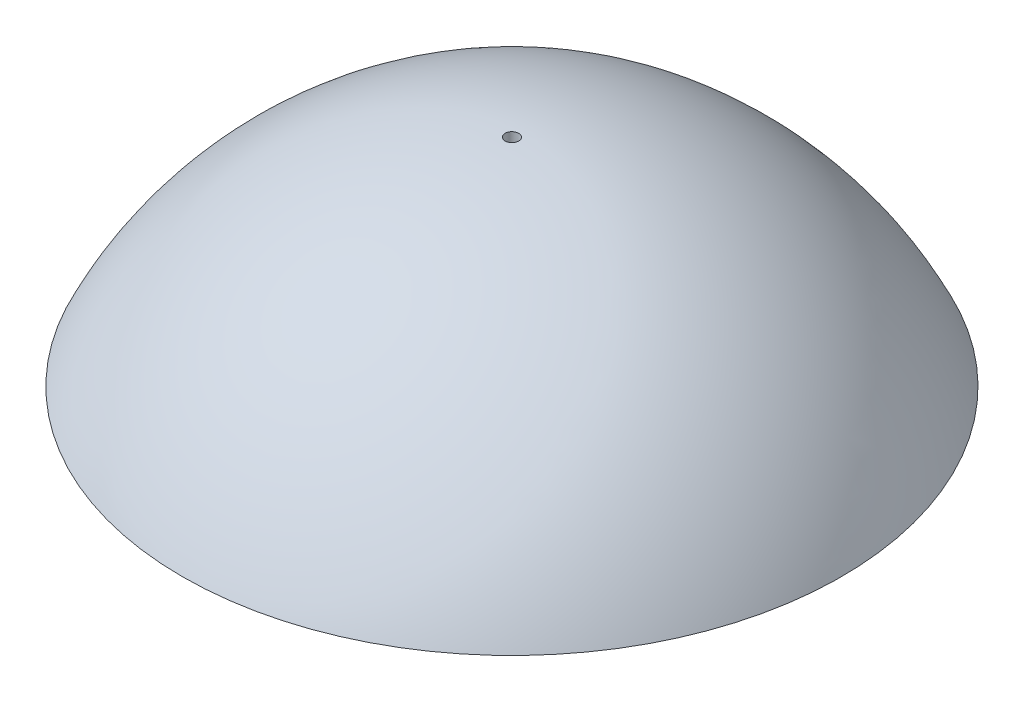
ISO-10303-21;
HEADER;
FILE_DESCRIPTION(('STEP AP214'),'2;1');
FILE_NAME('part.step','',(''),(''),'','','');
FILE_SCHEMA(('AUTOMOTIVE_DESIGN { 1 0 10303 214 1 1 1 1 }'));
ENDSEC;
DATA;
#1=APPLICATION_CONTEXT('core data for automotive mechanical design processes');
#2=APPLICATION_PROTOCOL_DEFINITION('international standard','automotive_design',2000,#1);
#3=PRODUCT_CONTEXT('',#1,'mechanical');
#4=PRODUCT('Part','Part','',(#3));
#5=PRODUCT_RELATED_PRODUCT_CATEGORY('part','',(#4));
#6=PRODUCT_DEFINITION_FORMATION('','',#4);
#7=PRODUCT_DEFINITION_CONTEXT('part definition',#1,'design');
#8=PRODUCT_DEFINITION('design','',#6,#7);
#9=PRODUCT_DEFINITION_SHAPE('','',#8);
#10=(LENGTH_UNIT() NAMED_UNIT(*) SI_UNIT(.MILLI.,.METRE.));
#11=(NAMED_UNIT(*) PLANE_ANGLE_UNIT() SI_UNIT($,.RADIAN.));
#12=(NAMED_UNIT(*) SI_UNIT($,.STERADIAN.) SOLID_ANGLE_UNIT());
#13=UNCERTAINTY_MEASURE_WITH_UNIT(LENGTH_MEASURE(1.E-05),#10,'distance_accuracy_value','');
#14=(GEOMETRIC_REPRESENTATION_CONTEXT(3) GLOBAL_UNCERTAINTY_ASSIGNED_CONTEXT((#13)) GLOBAL_UNIT_ASSIGNED_CONTEXT((#10,
#11,#12)) REPRESENTATION_CONTEXT('',''));
#15=CARTESIAN_POINT('',(0.,0.,0.));
#16=DIRECTION('',(0.,0.,1.));
#17=DIRECTION('',(1.,0.,0.));
#18=AXIS2_PLACEMENT_3D('',#15,#16,#17);
#19=CARTESIAN_POINT('',(0.,59.3847673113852,0.));
#20=CARTESIAN_POINT('',(0.,59.8901645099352,52.5535567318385));
#21=CARTESIAN_POINT('',(0.,26.0046128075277,99.8897687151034));
#22=CARTESIAN_POINT('',(0.,-20.1902768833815,121.482653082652));
#23=B_SPLINE_CURVE_WITH_KNOTS('',3,(#19,#20,#21,#22),.UNSPECIFIED.,.F.,.F.,(4,4),(0.,1.),.UNSPECIFIED.);
#24=CARTESIAN_POINT('',(0.,0.,0.));
#25=DIRECTION('',(0.,1.,0.));
#26=AXIS1_PLACEMENT('',#24,#25);
#27=SURFACE_OF_REVOLUTION('',#23,#26);
#28=CARTESIAN_POINT('',(0.,59.383030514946,0.));
#29=DIRECTION('',(0.,1.,0.));
#30=DIRECTION('',(0.,0.,1.));
#31=AXIS2_PLACEMENT_3D('',#28,#29,#30);
#32=CIRCLE('',#31,2.4892);
#33=CARTESIAN_POINT('',(0.,59.383030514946,2.4892));
#34=VERTEX_POINT('',#33);
#35=EDGE_CURVE('E51',#34,#34,#32,.T.);
#36=ORIENTED_EDGE('',*,*,#35,.F.);
#37=EDGE_LOOP('',(#36));
#38=FACE_BOUND('',#37,.T.);
#39=CARTESIAN_POINT('',(0.,-20.1902768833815,0.));
#40=DIRECTION('',(0.,1.,0.));
#41=DIRECTION('',(0.,0.,1.));
#42=AXIS2_PLACEMENT_3D('',#39,#40,#41);
#43=CIRCLE('',#42,121.482653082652);
#44=CARTESIAN_POINT('',(0.,-20.1902768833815,121.482653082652));
#45=VERTEX_POINT('',#44);
#46=EDGE_CURVE('E39',#45,#45,#43,.T.);
#47=ORIENTED_EDGE('',*,*,#46,.T.);
#48=EDGE_LOOP('',(#47));
#49=FACE_BOUND('',#48,.T.);
#50=ADVANCED_FACE('F32',(#38,#49),#27,.F.);
#51=CARTESIAN_POINT('',(0.,-112.210519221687,-3.6062110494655E-12));
#52=DIRECTION('',(0.,1.,0.));
#53=DIRECTION('',(0.,0.,1.));
#54=AXIS2_PLACEMENT_3D('',#51,#52,#53);
#55=SPHERICAL_SURFACE('',#54,152.400000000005);
#56=CARTESIAN_POINT('',(0.,0.,0.));
#57=DIRECTION('',(0.,1.,0.));
#58=DIRECTION('',(0.,0.,1.));
#59=AXIS2_PLACEMENT_3D('',#56,#57,#58);
#60=CIRCLE('',#59,103.124);
#61=CARTESIAN_POINT('',(0.,0.,103.124));
#62=VERTEX_POINT('',#61);
#63=EDGE_CURVE('E43',#62,#62,#60,.T.);
#64=CARTESIAN_POINT('',(0.,0.,103.124));
#65=CARTESIAN_POINT('',(0.,-0.192607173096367,103.333578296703));
#66=CARTESIAN_POINT('',(0.,-0.385801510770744,103.542616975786));
#67=CARTESIAN_POINT('',(0.,-0.773358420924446,103.959608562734));
#68=CARTESIAN_POINT('',(0.,-0.967720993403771,104.167561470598));
#69=CARTESIAN_POINT('',(0.,-1.3576082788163,104.582374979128));
#70=CARTESIAN_POINT('',(0.,-1.5531329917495,104.789235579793));
#71=CARTESIAN_POINT('',(0.,-1.9453384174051,105.20185798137));
#72=CARTESIAN_POINT('',(0.,-2.14201913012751,105.407619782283));
#73=CARTESIAN_POINT('',(0.,-2.53653038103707,105.818038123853));
#74=CARTESIAN_POINT('',(0.,-2.73436091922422,106.02269466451));
#75=CARTESIAN_POINT('',(0.,-3.13116560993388,106.430896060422));
#76=CARTESIAN_POINT('',(0.,-3.33013976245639,106.634440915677));
#77=CARTESIAN_POINT('',(0.,-3.72922543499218,107.040412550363));
#78=CARTESIAN_POINT('',(0.,-3.92933695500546,107.242839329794));
#79=CARTESIAN_POINT('',(0.,-4.33069107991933,107.646568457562));
#80=CARTESIAN_POINT('',(0.,-4.53193368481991,107.847870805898));
#81=CARTESIAN_POINT('',(0.,-4.93554366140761,108.249344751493));
#82=CARTESIAN_POINT('',(0.,-5.13791103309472,108.449516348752));
#83=CARTESIAN_POINT('',(0.,-5.54376418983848,108.848722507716));
#84=CARTESIAN_POINT('',(0.,-5.74724997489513,109.04775706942));
#85=CARTESIAN_POINT('',(0.,-6.15533356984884,109.444682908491));
#86=CARTESIAN_POINT('',(0.,-6.35993137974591,109.642574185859));
#87=CARTESIAN_POINT('',(0.,-6.77023260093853,110.037207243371));
#88=CARTESIAN_POINT('',(0.,-6.97593601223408,110.233949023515));
#89=CARTESIAN_POINT('',(0.,-7.38844197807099,110.626276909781));
#90=CARTESIAN_POINT('',(0.,-7.59524453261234,110.821863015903));
#91=CARTESIAN_POINT('',(0.,-8.00994229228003,111.21187341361));
#92=CARTESIAN_POINT('',(0.,-8.21783749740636,111.406297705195));
#93=CARTESIAN_POINT('',(0.,-8.6347140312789,111.793978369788));
#94=CARTESIAN_POINT('',(0.,-8.84369536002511,111.987234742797));
#95=CARTESIAN_POINT('',(0.,-9.26273758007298,112.372573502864));
#96=CARTESIAN_POINT('',(0.,-9.47279847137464,112.564655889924));
#97=CARTESIAN_POINT('',(0.,-9.8939932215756,112.947640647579));
#98=CARTESIAN_POINT('',(0.,-10.1051270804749,113.138543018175));
#99=CARTESIAN_POINT('',(0.,-10.5284611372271,113.519161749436));
#100=CARTESIAN_POINT('',(0.,-10.7406613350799,113.708878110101));
#101=CARTESIAN_POINT('',(0.,-11.1661214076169,114.087118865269));
#102=CARTESIAN_POINT('',(0.,-11.379381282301,114.275643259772));
#103=CARTESIAN_POINT('',(0.,-11.8069540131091,114.651494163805));
#104=CARTESIAN_POINT('',(0.,-12.0212668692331,114.838820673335));
#105=CARTESIAN_POINT('',(0.,-12.4509388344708,115.212269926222));
#106=CARTESIAN_POINT('',(0.,-12.6662979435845,115.398392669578));
#107=CARTESIAN_POINT('',(0.,-13.0980556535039,115.769428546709));
#108=CARTESIAN_POINT('',(0.,-13.3144542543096,115.954341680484));
#109=CARTESIAN_POINT('',(0.,-13.7482841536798,116.322952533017));
#110=CARTESIAN_POINT('',(0.,-13.9657154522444,116.506650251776));
#111=CARTESIAN_POINT('',(0.,-14.4016039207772,116.872824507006));
#112=CARTESIAN_POINT('',(0.,-14.6200610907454,117.055301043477));
#113=CARTESIAN_POINT('',(0.,-15.0579944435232,117.419027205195));
#114=CARTESIAN_POINT('',(0.,-15.2774706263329,117.600276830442));
#115=CARTESIAN_POINT('',(0.,-15.7174351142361,117.9615434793));
#116=CARTESIAN_POINT('',(0.,-15.9379234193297,118.141560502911));
#117=CARTESIAN_POINT('',(0.,-16.3799052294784,118.50035629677));
#118=CARTESIAN_POINT('',(0.,-16.6013987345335,118.679135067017));
#119=CARTESIAN_POINT('',(0.,-17.0453839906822,119.035448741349));
#120=CARTESIAN_POINT('',(0.,-17.2678757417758,119.212983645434));
#121=CARTESIAN_POINT('',(0.,-17.7138505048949,119.566804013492));
#122=CARTESIAN_POINT('',(0.,-17.9373335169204,119.743089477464));
#123=CARTESIAN_POINT('',(0.,-18.3852837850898,120.094405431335));
#124=CARTESIAN_POINT('',(0.,-18.6097510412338,120.269435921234));
#125=CARTESIAN_POINT('',(0.,-19.0596627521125,120.618236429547));
#126=CARTESIAN_POINT('',(0.,-19.2851072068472,120.79200644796));
#127=CARTESIAN_POINT('',(0.,-19.7369662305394,121.138280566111));
#128=CARTESIAN_POINT('',(0.,-19.9633807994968,121.310784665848));
#129=CARTESIAN_POINT('',(0.,-20.1902768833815,121.482653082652));
#130=B_SPLINE_CURVE_WITH_KNOTS('',3,(#64,#65,#66,#67,#68,#69,#70,#71,#72,#73,#74,#75,#76,#77,
#78,#79,#80,#81,#82,#83,#84,#85,#86,#87,#88,#89,#90,#91,#92,#93,#94,#95,#96,#97,#98,#99,#100,
#101,#102,#103,#104,#105,#106,#107,#108,#109,#110,#111,#112,#113,#114,#115,#116,#117,#118,#119,
#120,#121,#122,#123,#124,#125,#126,#127,#128,#129),.UNSPECIFIED.,.F.,.F.,(4,2,2,2,2,2,2,2,2,2,2,
2,2,2,2,2,2,2,2,2,2,2,2,2,2,2,2,2,2,2,2,2,4),(0.,0.853922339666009,1.70784467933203,
2.56176701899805,3.41568935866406,4.26961169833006,5.12353403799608,5.9774563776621,
6.83137871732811,7.68530105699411,8.53922339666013,9.39314573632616,10.2470680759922,
11.1009904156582,11.9549127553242,12.8088350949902,13.6627574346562,14.5166797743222,
15.3706021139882,16.2245244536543,17.0784467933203,17.9323691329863,18.7862914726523,
19.6402138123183,20.4941361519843,21.3480584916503,22.2019808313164,23.0559031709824,
23.9098255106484,24.7637478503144,25.6176701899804,26.4715925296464,27.3255148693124),.UNSPECIFIED.);
#131=EDGE_CURVE('BSEAM77',#62,#45,#130,.T.);
#132=ORIENTED_EDGE('',*,*,#63,.T.);
#133=ORIENTED_EDGE('',*,*,#46,.F.);
#134=ORIENTED_EDGE('',*,*,#131,.T.);
#135=ORIENTED_EDGE('',*,*,#131,.F.);
#136=EDGE_LOOP('',(#132,#134,#133,#135));
#137=FACE_BOUND('',#136,.T.);
#138=ADVANCED_FACE('F77',(#137),#55,.F.);
#139=CARTESIAN_POINT('',(0.,0.,103.124));
#140=DIRECTION('',(0.,-1.,0.));
#141=DIRECTION('',(0.,0.,-1.));
#142=AXIS2_PLACEMENT_3D('',#139,#140,#141);
#143=PLANE('',#142);
#144=CARTESIAN_POINT('',(0.,0.,0.));
#145=DIRECTION('',(0.,1.,0.));
#146=DIRECTION('',(0.,0.,1.));
#147=AXIS2_PLACEMENT_3D('',#144,#145,#146);
#148=CIRCLE('',#147,99.3784789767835);
#149=CARTESIAN_POINT('',(0.,0.,99.3784789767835));
#150=VERTEX_POINT('',#149);
#151=EDGE_CURVE('E47',#150,#150,#148,.T.);
#152=ORIENTED_EDGE('',*,*,#151,.T.);
#153=EDGE_LOOP('',(#152));
#154=FACE_BOUND('',#153,.T.);
#155=ORIENTED_EDGE('',*,*,#63,.F.);
#156=EDGE_LOOP('',(#155));
#157=FACE_BOUND('',#156,.T.);
#158=ADVANCED_FACE('F82',(#154,#157),#143,.T.);
#159=CARTESIAN_POINT('',(0.,-58.3182780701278,0.));
#160=DIRECTION('',(0.,1.,0.));
#161=DIRECTION('',(0.,0.,1.));
#162=AXIS2_PLACEMENT_3D('',#159,#160,#161);
#163=DEGENERATE_TOROIDAL_SURFACE('',#162,0.807169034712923,114.530889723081,.T.);
#164=CARTESIAN_POINT('',(0.,46.5827453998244,0.));
#165=DIRECTION('',(0.,-1.,0.));
#166=DIRECTION('',(0.,0.,-1.));
#167=AXIS2_PLACEMENT_3D('',#164,#165,#166);
#168=CIRCLE('',#167,46.775636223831);
#169=CARTESIAN_POINT('',(0.,46.5827453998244,-46.775636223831));
#170=VERTEX_POINT('',#169);
#171=EDGE_CURVE('E10',#170,#170,#168,.T.);
#172=ORIENTED_EDGE('',*,*,#171,.F.);
#173=EDGE_LOOP('',(#172));
#174=FACE_BOUND('',#173,.T.);
#175=ORIENTED_EDGE('',*,*,#151,.F.);
#176=EDGE_LOOP('',(#175));
#177=FACE_BOUND('',#176,.T.);
#178=ADVANCED_FACE('F73',(#174,#177),#163,.F.);
#179=CARTESIAN_POINT('',(0.,59.6374659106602,0.));
#180=DIRECTION('',(0.,-1.,0.));
#181=DIRECTION('',(0.,0.,-1.));
#182=AXIS2_PLACEMENT_3D('',#179,#180,#181);
#183=CYLINDRICAL_SURFACE('',#182,2.4892);
#184=ORIENTED_EDGE('',*,*,#35,.T.);
#185=EDGE_LOOP('',(#184));
#186=FACE_BOUND('',#185,.T.);
#187=CARTESIAN_POINT('',(0.,46.5827453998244,0.));
#188=DIRECTION('',(0.,-1.,0.));
#189=DIRECTION('',(0.,0.,-1.));
#190=AXIS2_PLACEMENT_3D('',#187,#188,#189);
#191=CIRCLE('',#190,2.4892);
#192=CARTESIAN_POINT('',(0.,46.5827453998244,-2.4892));
#193=VERTEX_POINT('',#192);
#194=EDGE_CURVE('E61',#193,#193,#191,.T.);
#195=ORIENTED_EDGE('',*,*,#194,.T.);
#196=EDGE_LOOP('',(#195));
#197=FACE_BOUND('',#196,.T.);
#198=ADVANCED_FACE('F65',(#186,#197),#183,.F.);
#199=CARTESIAN_POINT('',(2.4892,46.5827453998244,0.));
#200=DIRECTION('',(0.,-1.,0.));
#201=DIRECTION('',(0.,0.,-1.));
#202=AXIS2_PLACEMENT_3D('',#199,#200,#201);
#203=PLANE('',#202);
#204=ORIENTED_EDGE('',*,*,#171,.T.);
#205=EDGE_LOOP('',(#204));
#206=FACE_BOUND('',#205,.T.);
#207=ORIENTED_EDGE('',*,*,#194,.F.);
#208=EDGE_LOOP('',(#207));
#209=FACE_BOUND('',#208,.T.);
#210=ADVANCED_FACE('F67',(#206,#209),#203,.T.);
#211=CLOSED_SHELL('',(#50,#138,#158,#178,#198,#210));
#212=MANIFOLD_SOLID_BREP('B2',#211);
#213=ADVANCED_BREP_SHAPE_REPRESENTATION('',(#18,#212),#14);
#214=SHAPE_DEFINITION_REPRESENTATION(#9,#213);
ENDSEC;
END-ISO-10303-21;
